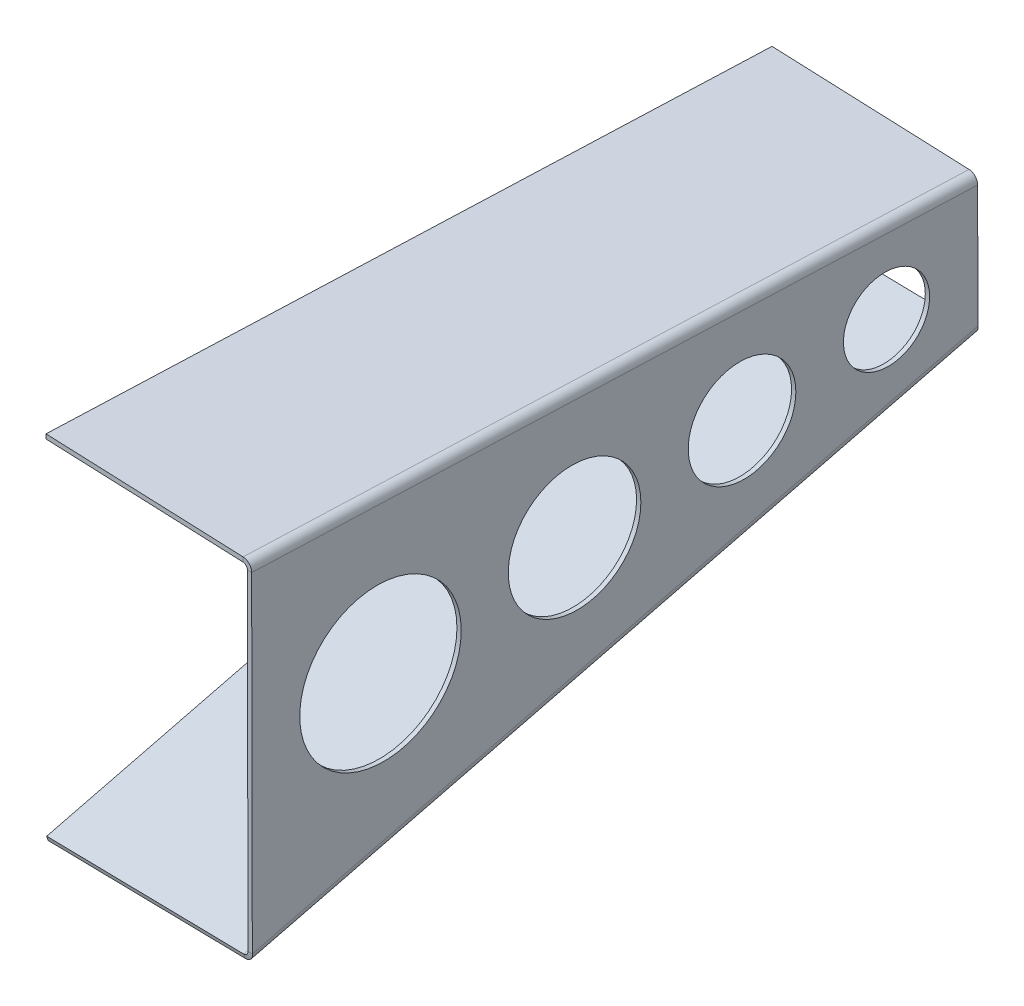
ISO-10303-21;
HEADER;
FILE_DESCRIPTION(('STEP AP214'),'2;1');
FILE_NAME('part.step','',(''),(''),'','','');
FILE_SCHEMA(('AUTOMOTIVE_DESIGN { 1 0 10303 214 1 1 1 1 }'));
ENDSEC;
DATA;
#1=APPLICATION_CONTEXT('core data for automotive mechanical design processes');
#2=APPLICATION_PROTOCOL_DEFINITION('international standard','automotive_design',2000,#1);
#3=PRODUCT_CONTEXT('',#1,'mechanical');
#4=PRODUCT('Part','Part','',(#3));
#5=PRODUCT_RELATED_PRODUCT_CATEGORY('part','',(#4));
#6=PRODUCT_DEFINITION_FORMATION('','',#4);
#7=PRODUCT_DEFINITION_CONTEXT('part definition',#1,'design');
#8=PRODUCT_DEFINITION('design','',#6,#7);
#9=PRODUCT_DEFINITION_SHAPE('','',#8);
#10=(LENGTH_UNIT() NAMED_UNIT(*) SI_UNIT(.MILLI.,.METRE.));
#11=(NAMED_UNIT(*) PLANE_ANGLE_UNIT() SI_UNIT($,.RADIAN.));
#12=(NAMED_UNIT(*) SI_UNIT($,.STERADIAN.) SOLID_ANGLE_UNIT());
#13=UNCERTAINTY_MEASURE_WITH_UNIT(LENGTH_MEASURE(1.E-05),#10,'distance_accuracy_value','');
#14=(GEOMETRIC_REPRESENTATION_CONTEXT(3) GLOBAL_UNCERTAINTY_ASSIGNED_CONTEXT((#13)) GLOBAL_UNIT_ASSIGNED_CONTEXT((#10,
#11,#12)) REPRESENTATION_CONTEXT('',''));
#15=CARTESIAN_POINT('',(0.,0.,0.));
#16=DIRECTION('',(0.,0.,1.));
#17=DIRECTION('',(1.,0.,0.));
#18=AXIS2_PLACEMENT_3D('',#15,#16,#17);
#19=CARTESIAN_POINT('',(3.40995484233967,-52.4237693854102,-1141.79603553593));
#20=DIRECTION('',(0.0392132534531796,7.70222097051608E-05,-0.999230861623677));
#21=DIRECTION('',(-0.00196418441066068,0.99999807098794,0.));
#22=AXIS2_PLACEMENT_3D('',#19,#20,#21);
#23=PLANE('',#22);
#24=DIRECTION('',(-0.999228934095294,-0.00196267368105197,-0.0392133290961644));
#25=VECTOR('',#24,1.);
#26=CARTESIAN_POINT('',(3.31655737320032,-4.87360634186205,-1141.79603553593));
#27=LINE('',#26,#25);
#28=CARTESIAN_POINT('',(4.94090392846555,-4.87041581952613,-1141.73229034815));
#29=VERTEX_POINT('',#28);
#30=CARTESIAN_POINT('',(3.31655737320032,-4.87360634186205,-1141.79603553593));
#31=VERTEX_POINT('',#30);
#32=EDGE_CURVE('E12',#29,#31,#27,.T.);
#33=ORIENTED_EDGE('',*,*,#32,.F.);
#34=DIRECTION('',(-0.00196418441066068,0.99999807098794,0.));
#35=VECTOR('',#34,1.);
#36=CARTESIAN_POINT('',(5.03430139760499,-52.4205788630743,-1141.73229034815));
#37=LINE('',#36,#35);
#38=CARTESIAN_POINT('',(5.02787209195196,-49.147315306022,-1141.73229034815));
#39=VERTEX_POINT('',#38);
#40=EDGE_CURVE('E140',#39,#29,#37,.T.);
#41=ORIENTED_EDGE('',*,*,#40,.F.);
#42=DIRECTION('',(-0.999228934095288,-0.00196267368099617,-0.0392133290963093));
#43=VECTOR('',#42,1.);
#44=CARTESIAN_POINT('',(3.40352553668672,-49.1505058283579,-1141.79603553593));
#45=LINE('',#44,#43);
#46=CARTESIAN_POINT('',(3.40352553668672,-49.1505058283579,-1141.79603553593));
#47=VERTEX_POINT('',#46);
#48=EDGE_CURVE('E93',#39,#47,#45,.T.);
#49=ORIENTED_EDGE('',*,*,#48,.T.);
#50=DIRECTION('',(-0.00196418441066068,0.99999807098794,0.));
#51=VECTOR('',#50,1.);
#52=CARTESIAN_POINT('',(3.40995484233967,-52.4237693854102,-1141.79603553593));
#53=LINE('',#52,#51);
#54=EDGE_CURVE('E142',#47,#31,#53,.T.);
#55=ORIENTED_EDGE('',*,*,#54,.T.);
#56=EDGE_LOOP('',(#33,#41,#49,#55));
#57=FACE_BOUND('',#56,.T.);
#58=ADVANCED_FACE('F82',(#57),#23,.T.);
#59=CARTESIAN_POINT('',(1.80375167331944,-52.4077804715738,-1142.32306807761));
#60=CARTESIAN_POINT('',(1.79667122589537,-51.8884337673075,-1142.16863895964));
#61=CARTESIAN_POINT('',(1.7895907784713,-51.3690870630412,-1142.01420984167));
#62=CARTESIAN_POINT('',(1.78251033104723,-50.849740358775,-1141.85978072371));
#63=CARTESIAN_POINT('',(-4.69363454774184,-52.4205425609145,-1142.57804882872));
#64=CARTESIAN_POINT('',(-3.6178172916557,-51.8990688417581,-1142.3811229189));
#65=CARTESIAN_POINT('',(-2.54200003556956,-51.3775951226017,-1142.18419700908));
#66=CARTESIAN_POINT('',(-1.46618277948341,-50.8561214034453,-1141.98727109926));
#67=CARTESIAN_POINT('',(-4.74277993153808,-45.9123743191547,-1141.65147412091));
#68=CARTESIAN_POINT('',(-3.6528017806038,-46.4295940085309,-1141.76340644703));
#69=CARTESIAN_POINT('',(-2.56282362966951,-46.946813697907,-1141.87533877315));
#70=CARTESIAN_POINT('',(-1.47284547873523,-47.4640333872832,-1141.98727109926));
#71=CARTESIAN_POINT('',(1.7546062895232,-45.899612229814,-1141.3964933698));
#72=CARTESIAN_POINT('',(1.76168673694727,-46.4189589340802,-1141.55092248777));
#73=CARTESIAN_POINT('',(1.76876718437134,-46.9383056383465,-1141.70535160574));
#74=CARTESIAN_POINT('',(1.77584763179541,-47.4576523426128,-1141.85978072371));
#75=CARTESIAN_POINT('',(8.25199251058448,-45.8868501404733,-1141.14151261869));
#76=CARTESIAN_POINT('',(7.17617525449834,-46.4083238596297,-1141.33843852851));
#77=CARTESIAN_POINT('',(6.10035799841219,-46.929797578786,-1141.53536443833));
#78=CARTESIAN_POINT('',(5.02454074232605,-47.4512712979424,-1141.73229034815));
#79=CARTESIAN_POINT('',(8.30113789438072,-52.3950183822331,-1142.0680873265));
#80=CARTESIAN_POINT('',(7.21115974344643,-51.8777986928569,-1141.95615500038));
#81=CARTESIAN_POINT('',(6.12118159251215,-51.3605790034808,-1141.84422267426));
#82=CARTESIAN_POINT('',(5.03120344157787,-50.8433593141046,-1141.73229034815));
#83=CARTESIAN_POINT('',(1.80375167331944,-52.4077804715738,-1142.32306807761));
#84=CARTESIAN_POINT('',(1.79667122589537,-51.8884337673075,-1142.16863895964));
#85=CARTESIAN_POINT('',(1.7895907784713,-51.3690870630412,-1142.01420984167));
#86=CARTESIAN_POINT('',(1.78251033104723,-50.849740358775,-1141.85978072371));
#87=(BOUNDED_SURFACE() B_SPLINE_SURFACE(3,3,((#59,#60,#61,#62),(#63,#64,#65,#66),(#67,#68,#69,
#70),(#71,#72,#73,#74),(#75,#76,#77,#78),(#79,#80,#81,#82),(#83,#84,#85,#86)),.UNSPECIFIED.,.T.,
.F.,.F.) B_SPLINE_SURFACE_WITH_KNOTS((4,3,4),(4,4),(0.,0.5,1.),(0.,1.),
.UNSPECIFIED.) GEOMETRIC_REPRESENTATION_ITEM() RATIONAL_B_SPLINE_SURFACE(((1.,1.,1.,1.),
(0.333333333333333,0.333333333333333,0.333333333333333,0.333333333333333),(0.333333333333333,
0.333333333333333,0.333333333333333,0.333333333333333),(1.,1.,1.,1.),(0.333333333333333,
0.333333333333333,0.333333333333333,0.333333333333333),(0.333333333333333,0.333333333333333,
0.333333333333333,0.333333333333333),(1.,1.,1.,1.))) REPRESENTATION_ITEM('') SURFACE());
#88=CARTESIAN_POINT('',(1.77917898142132,-49.1536963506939,-1141.85978072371));
#89=DIRECTION('',(-0.0385441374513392,-0.141130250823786,0.989240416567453));
#90=DIRECTION('',(0.00747574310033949,-0.989989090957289,-0.140945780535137));
#91=AXIS2_PLACEMENT_3D('',#88,#89,#90);
#92=ELLIPSE('',#91,3.28698987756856,3.2512);
#93=CARTESIAN_POINT('',(1.86590869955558,-52.4070626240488,-1142.32054381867));
#94=VERTEX_POINT('',#93);
#95=EDGE_CURVE('E187',#39,#94,#92,.F.);
#96=DIRECTION('',(-0.0321839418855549,0.95822700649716,0.284192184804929));
#97=VECTOR('',#96,1.);
#98=CARTESIAN_POINT('',(1.81359048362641,-50.8493688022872,-1141.85856100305));
#99=LINE('',#98,#97);
#100=CARTESIAN_POINT('',(1.81359048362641,-50.8493688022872,-1141.85856100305));
#101=VERTEX_POINT('',#100);
#102=EDGE_CURVE('E239',#94,#101,#99,.T.);
#103=CARTESIAN_POINT('',(1.77917898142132,-49.1536963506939,-1141.85978072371));
#104=DIRECTION('',(-0.0392132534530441,-7.70222097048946E-05,0.999230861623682));
#105=DIRECTION('',(0.00196418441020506,-0.999998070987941,0.));
#106=AXIS2_PLACEMENT_3D('',#103,#104,#105);
#107=ELLIPSE('',#106,1.69604727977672,1.6256);
#108=EDGE_CURVE('E317',#47,#101,#107,.F.);
#109=ORIENTED_EDGE('',*,*,#48,.F.);
#110=ORIENTED_EDGE('',*,*,#95,.T.);
#111=ORIENTED_EDGE('',*,*,#102,.T.);
#112=ORIENTED_EDGE('',*,*,#108,.F.);
#113=EDGE_LOOP('',(#109,#110,#111,#112));
#114=FACE_BOUND('',#113,.T.);
#115=ADVANCED_FACE('F358',(#114),#87,.T.);
#116=CARTESIAN_POINT('',(-72.7175233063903,-52.4851478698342,-1144.78354416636));
#117=DIRECTION('',(0.0313367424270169,0.285167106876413,-0.957965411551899));
#118=DIRECTION('',(0.998990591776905,0.0219254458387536,0.0392055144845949));
#119=AXIS2_PLACEMENT_3D('',#116,#117,#118);
#120=PLANE('',#119);
#121=ORIENTED_EDGE('',*,*,#102,.F.);
#122=DIRECTION('',(0.998990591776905,0.0219254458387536,0.0392055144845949));
#123=VECTOR('',#122,1.);
#124=CARTESIAN_POINT('',(-72.6652050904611,-54.042841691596,-1145.24552698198));
#125=LINE('',#124,#123);
#126=CARTESIAN_POINT('',(-72.6652050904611,-54.0428416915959,-1145.24552698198));
#127=VERTEX_POINT('',#126);
#128=EDGE_CURVE('E344',#127,#94,#125,.T.);
#129=ORIENTED_EDGE('',*,*,#128,.F.);
#130=DIRECTION('',(-0.0321839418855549,0.95822700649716,0.284192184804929));
#131=VECTOR('',#130,1.);
#132=CARTESIAN_POINT('',(-72.7175233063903,-52.4851478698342,-1144.78354416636));
#133=LINE('',#132,#131);
#134=CARTESIAN_POINT('',(-72.7175233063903,-52.4851478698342,-1144.78354416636));
#135=VERTEX_POINT('',#134);
#136=EDGE_CURVE('E235',#127,#135,#133,.T.);
#137=ORIENTED_EDGE('',*,*,#136,.T.);
#138=DIRECTION('',(0.998990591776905,0.0219254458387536,0.0392055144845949));
#139=VECTOR('',#138,1.);
#140=CARTESIAN_POINT('',(-72.7175233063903,-52.4851478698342,-1144.78354416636));
#141=LINE('',#140,#139);
#142=EDGE_CURVE('E298',#135,#101,#141,.T.);
#143=ORIENTED_EDGE('',*,*,#142,.T.);
#144=EDGE_LOOP('',(#121,#129,#137,#143));
#145=FACE_BOUND('',#144,.T.);
#146=ADVANCED_FACE('F366',(#145),#120,.T.);
#147=CARTESIAN_POINT('',(-82.5292291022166,-128.088396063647,-890.978905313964));
#148=DIRECTION('',(-0.998795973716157,-0.020301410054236,-0.0446593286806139));
#149=DIRECTION('',(0.0370242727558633,0.285287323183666,-0.95772665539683));
#150=AXIS2_PLACEMENT_3D('',#147,#148,#149);
#151=PLANE('',#150);
#152=ORIENTED_EDGE('',*,*,#136,.F.);
#153=DIRECTION('',(0.0370242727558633,0.285287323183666,-0.95772665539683));
#154=VECTOR('',#153,1.);
#155=CARTESIAN_POINT('',(-82.4769108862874,-129.646089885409,-891.440888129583));
#156=LINE('',#155,#154);
#157=CARTESIAN_POINT('',(-82.4769108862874,-129.646089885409,-891.440888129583));
#158=VERTEX_POINT('',#157);
#159=EDGE_CURVE('E196',#158,#127,#156,.T.);
#160=ORIENTED_EDGE('',*,*,#159,.F.);
#161=DIRECTION('',(-0.0321839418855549,0.95822700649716,0.284192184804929));
#162=VECTOR('',#161,1.);
#163=CARTESIAN_POINT('',(-82.5292291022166,-128.088396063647,-890.978905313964));
#164=LINE('',#163,#162);
#165=CARTESIAN_POINT('',(-82.5292291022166,-128.088396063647,-890.978905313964));
#166=VERTEX_POINT('',#165);
#167=EDGE_CURVE('E231',#158,#166,#164,.T.);
#168=ORIENTED_EDGE('',*,*,#167,.T.);
#169=DIRECTION('',(0.0370242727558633,0.285287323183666,-0.95772665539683));
#170=VECTOR('',#169,1.);
#171=CARTESIAN_POINT('',(-82.5292291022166,-128.088396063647,-890.978905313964));
#172=LINE('',#171,#170);
#173=EDGE_CURVE('E294',#166,#135,#172,.T.);
#174=ORIENTED_EDGE('',*,*,#173,.T.);
#175=EDGE_LOOP('',(#152,#160,#168,#174));
#176=FACE_BOUND('',#175,.T.);
#177=ADVANCED_FACE('F395',(#176),#151,.T.);
#178=CARTESIAN_POINT('',(-4.78062925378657,-126.382000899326,-887.927651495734));
#179=DIRECTION('',(-0.0313367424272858,-0.285167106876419,0.957965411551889));
#180=DIRECTION('',(-0.998990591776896,-0.021925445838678,-0.0392055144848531));
#181=AXIS2_PLACEMENT_3D('',#178,#179,#180);
#182=PLANE('',#181);
#183=ORIENTED_EDGE('',*,*,#167,.F.);
#184=DIRECTION('',(-0.998990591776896,-0.021925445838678,-0.0392055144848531));
#185=VECTOR('',#184,1.);
#186=CARTESIAN_POINT('',(-4.72831103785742,-127.939694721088,-888.389634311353));
#187=LINE('',#186,#185);
#188=CARTESIAN_POINT('',(-7.9457970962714,-128.010310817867,-888.515904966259));
#189=VERTEX_POINT('',#188);
#190=EDGE_CURVE('E184',#189,#158,#187,.T.);
#191=ORIENTED_EDGE('',*,*,#190,.F.);
#192=DIRECTION('',(-0.032183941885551,0.958227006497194,0.284192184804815));
#193=VECTOR('',#192,1.);
#194=CARTESIAN_POINT('',(-7.99811531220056,-126.452616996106,-888.05392215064));
#195=LINE('',#194,#193);
#196=CARTESIAN_POINT('',(-7.99811531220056,-126.452616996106,-888.05392215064));
#197=VERTEX_POINT('',#196);
#198=EDGE_CURVE('E227',#189,#197,#195,.T.);
#199=ORIENTED_EDGE('',*,*,#198,.T.);
#200=DIRECTION('',(-0.998990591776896,-0.021925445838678,-0.0392055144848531));
#201=VECTOR('',#200,1.);
#202=CARTESIAN_POINT('',(-4.78062925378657,-126.382000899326,-887.927651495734));
#203=LINE('',#202,#201);
#204=EDGE_CURVE('E302',#197,#166,#203,.T.);
#205=ORIENTED_EDGE('',*,*,#204,.T.);
#206=EDGE_LOOP('',(#183,#191,#199,#205));
#207=FACE_BOUND('',#206,.T.);
#208=ADVANCED_FACE('F396',(#207),#182,.T.);
#209=CARTESIAN_POINT('',(-8.00795412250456,-128.011028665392,-888.518429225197));
#210=CARTESIAN_POINT('',(-8.01503456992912,-127.491681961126,-888.364000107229));
#211=CARTESIAN_POINT('',(-8.02211501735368,-126.97233525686,-888.209570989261));
#212=CARTESIAN_POINT('',(-8.02919546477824,-126.452988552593,-888.055141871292));
#213=CARTESIAN_POINT('',(-1.51056790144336,-127.998266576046,-888.263448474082));
#214=CARTESIAN_POINT('',(-2.60054605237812,-127.481046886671,-888.151516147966));
#215=CARTESIAN_POINT('',(-3.69052420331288,-126.963827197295,-888.03958382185));
#216=CARTESIAN_POINT('',(-4.78050235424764,-126.44660750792,-887.927651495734));
#217=CARTESIAN_POINT('',(-1.55971328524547,-121.490098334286,-887.336873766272));
#218=CARTESIAN_POINT('',(-2.63553054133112,-122.011572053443,-887.533799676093));
#219=CARTESIAN_POINT('',(-3.71134779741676,-122.533045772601,-887.730725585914));
#220=CARTESIAN_POINT('',(-4.7871650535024,-123.054519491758,-887.927651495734));
#221=CARTESIAN_POINT('',(-8.05709950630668,-121.502860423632,-887.591854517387));
#222=CARTESIAN_POINT('',(-8.05001905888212,-122.022207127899,-887.746283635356));
#223=CARTESIAN_POINT('',(-8.04293861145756,-122.541553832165,-887.900712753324));
#224=CARTESIAN_POINT('',(-8.035858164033,-123.060900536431,-888.055141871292));
#225=CARTESIAN_POINT('',(-14.5544857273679,-121.515622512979,-887.846835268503));
#226=CARTESIAN_POINT('',(-13.4645075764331,-122.032842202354,-887.958767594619));
#227=CARTESIAN_POINT('',(-12.3745294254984,-122.550061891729,-888.070699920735));
#228=CARTESIAN_POINT('',(-11.2845512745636,-123.067281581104,-888.18263224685));
#229=CARTESIAN_POINT('',(-14.5053403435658,-128.023790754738,-888.773409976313));
#230=CARTESIAN_POINT('',(-13.4295230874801,-127.502317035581,-888.576484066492));
#231=CARTESIAN_POINT('',(-12.3537058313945,-126.980843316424,-888.379558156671));
#232=CARTESIAN_POINT('',(-11.2778885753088,-126.459369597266,-888.18263224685));
#233=CARTESIAN_POINT('',(-8.00795412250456,-128.011028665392,-888.518429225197));
#234=CARTESIAN_POINT('',(-8.01503456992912,-127.491681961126,-888.364000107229));
#235=CARTESIAN_POINT('',(-8.02211501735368,-126.97233525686,-888.209570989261));
#236=CARTESIAN_POINT('',(-8.02919546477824,-126.452988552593,-888.055141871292));
#237=(BOUNDED_SURFACE() B_SPLINE_SURFACE(3,3,((#209,#210,#211,#212),(#213,#214,#215,#216),(#217,
#218,#219,#220),(#221,#222,#223,#224),(#225,#226,#227,#228),(#229,#230,#231,#232),(#233,#234,
#235,#236)),.UNSPECIFIED.,.T.,.F.,.F.) B_SPLINE_SURFACE_WITH_KNOTS((4,3,4),(4,4),(0.,0.5,1.),
(0.,1.),.UNSPECIFIED.) GEOMETRIC_REPRESENTATION_ITEM() RATIONAL_B_SPLINE_SURFACE(((1.,1.,1.,1.),
(0.333333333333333,0.333333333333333,0.333333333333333,0.333333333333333),(0.333333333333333,
0.333333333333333,0.333333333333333,0.333333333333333),(1.,1.,1.,1.),(0.333333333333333,
0.333333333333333,0.333333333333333,0.333333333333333),(0.333333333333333,0.333333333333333,
0.333333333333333,0.333333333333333),(1.,1.,1.,1.))) REPRESENTATION_ITEM('') SURFACE());
#238=CARTESIAN_POINT('',(-8.03252681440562,-124.756944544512,-888.055141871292));
#239=DIRECTION('',(0.0385441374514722,0.141130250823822,-0.989240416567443));
#240=DIRECTION('',(0.00747574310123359,-0.989989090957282,-0.140945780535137));
#241=AXIS2_PLACEMENT_3D('',#238,#239,#240);
#242=ELLIPSE('',#241,3.28698987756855,3.2512);
#243=CARTESIAN_POINT('',(-4.78383370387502,-124.75056349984,-887.927651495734));
#244=VERTEX_POINT('',#243);
#245=EDGE_CURVE('E180',#189,#244,#242,.F.);
#246=DIRECTION('',(-0.999228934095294,-0.00196267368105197,-0.0392133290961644));
#247=VECTOR('',#246,1.);
#248=CARTESIAN_POINT('',(-6.40818025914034,-124.753754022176,-887.991396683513));
#249=LINE('',#248,#247);
#250=CARTESIAN_POINT('',(-6.40818025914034,-124.753754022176,-887.991396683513));
#251=VERTEX_POINT('',#250);
#252=EDGE_CURVE('E224',#244,#251,#249,.T.);
#253=CARTESIAN_POINT('',(-8.03252681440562,-124.756944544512,-888.055141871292));
#254=DIRECTION('',(0.0392132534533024,7.7022209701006E-05,-0.999230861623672));
#255=DIRECTION('',(0.00196418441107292,-0.999998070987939,0.));
#256=AXIS2_PLACEMENT_3D('',#253,#254,#255);
#257=ELLIPSE('',#256,1.69604727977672,1.6256);
#258=EDGE_CURVE('E313',#197,#251,#257,.F.);
#259=ORIENTED_EDGE('',*,*,#198,.F.);
#260=ORIENTED_EDGE('',*,*,#245,.T.);
#261=ORIENTED_EDGE('',*,*,#252,.T.);
#262=ORIENTED_EDGE('',*,*,#258,.F.);
#263=EDGE_LOOP('',(#259,#260,#261,#262));
#264=FACE_BOUND('',#263,.T.);
#265=ADVANCED_FACE('F398',(#264),#237,.T.);
#266=CARTESIAN_POINT('',(-6.65002399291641,-1.62719526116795,-887.991396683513));
#267=DIRECTION('',(-0.0392132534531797,-7.70222097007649E-05,0.999230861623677));
#268=DIRECTION('',(0.00196418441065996,-0.99999807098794,0.));
#269=AXIS2_PLACEMENT_3D('',#266,#267,#268);
#270=PLANE('',#269);
#271=ORIENTED_EDGE('',*,*,#252,.F.);
#272=DIRECTION('',(0.00196418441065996,-0.99999807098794,0.));
#273=VECTOR('',#272,1.);
#274=CARTESIAN_POINT('',(-5.02567743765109,-1.62400473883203,-887.927651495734));
#275=LINE('',#274,#273);
#276=CARTESIAN_POINT('',(-5.01930087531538,-4.87041581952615,-887.927651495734));
#277=VERTEX_POINT('',#276);
#278=EDGE_CURVE('E173',#277,#244,#275,.T.);
#279=ORIENTED_EDGE('',*,*,#278,.F.);
#280=DIRECTION('',(-0.999228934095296,-0.00196267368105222,-0.0392133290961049));
#281=VECTOR('',#280,1.);
#282=CARTESIAN_POINT('',(-6.64364743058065,-4.87360634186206,-887.991396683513));
#283=LINE('',#282,#281);
#284=CARTESIAN_POINT('',(-6.64364743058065,-4.87360634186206,-887.991396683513));
#285=VERTEX_POINT('',#284);
#286=EDGE_CURVE('E220',#277,#285,#283,.T.);
#287=ORIENTED_EDGE('',*,*,#286,.T.);
#288=DIRECTION('',(0.00196418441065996,-0.99999807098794,0.));
#289=VECTOR('',#288,1.);
#290=CARTESIAN_POINT('',(-6.65002399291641,-1.62719526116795,-887.991396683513));
#291=LINE('',#290,#289);
#292=EDGE_CURVE('E274',#285,#251,#291,.T.);
#293=ORIENTED_EDGE('',*,*,#292,.T.);
#294=EDGE_LOOP('',(#271,#279,#287,#293));
#295=FACE_BOUND('',#294,.T.);
#296=ADVANCED_FACE('F404',(#295),#270,.T.);
#297=CARTESIAN_POINT('',(-8.26161293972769,-8.1279906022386,-888.055016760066));
#298=CARTESIAN_POINT('',(-8.26267562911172,-7.58612497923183,-888.05505846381));
#299=CARTESIAN_POINT('',(-8.26373831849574,-7.04425935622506,-888.055100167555));
#300=CARTESIAN_POINT('',(-8.26480100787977,-6.50239373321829,-888.0551418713));
#301=CARTESIAN_POINT('',(-1.76422671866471,-8.11522851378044,-887.800036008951));
#302=CARTESIAN_POINT('',(-2.84818711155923,-7.5754899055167,-887.842574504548));
#303=CARTESIAN_POINT('',(-3.93214750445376,-7.03575129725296,-887.885113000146));
#304=CARTESIAN_POINT('',(-5.01610789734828,-6.49601268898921,-887.927651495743));
#305=CARTESIAN_POINT('',(-1.77698881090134,-1.6128410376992,-887.800286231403));
#306=CARTESIAN_POINT('',(-2.85882382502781,-2.156833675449,-887.842741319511));
#307=CARTESIAN_POINT('',(-3.94065883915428,-2.70082631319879,-887.885196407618));
#308=CARTESIAN_POINT('',(-5.02249385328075,-3.24481895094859,-887.927651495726));
#309=CARTESIAN_POINT('',(-8.27437503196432,-1.62560312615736,-888.055266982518));
#310=CARTESIAN_POINT('',(-8.27331234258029,-2.16746874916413,-888.055225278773));
#311=CARTESIAN_POINT('',(-8.27224965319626,-2.7093343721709,-888.055183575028));
#312=CARTESIAN_POINT('',(-8.27118696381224,-3.25119999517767,-888.055141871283));
#313=CARTESIAN_POINT('',(-14.7717612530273,-1.63836521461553,-888.310247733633));
#314=CARTESIAN_POINT('',(-13.6878008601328,-2.17810382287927,-888.267709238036));
#315=CARTESIAN_POINT('',(-12.6038404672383,-2.71784243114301,-888.225170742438));
#316=CARTESIAN_POINT('',(-11.5198800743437,-3.25758103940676,-888.182632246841));
#317=CARTESIAN_POINT('',(-14.7589991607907,-8.14075269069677,-888.309997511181));
#318=CARTESIAN_POINT('',(-13.6771641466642,-7.59676005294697,-888.267542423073));
#319=CARTESIAN_POINT('',(-12.5953291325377,-7.05276741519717,-888.225087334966));
#320=CARTESIAN_POINT('',(-11.5134941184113,-6.50877477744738,-888.182632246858));
#321=CARTESIAN_POINT('',(-8.26161293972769,-8.1279906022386,-888.055016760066));
#322=CARTESIAN_POINT('',(-8.26267562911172,-7.58612497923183,-888.05505846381));
#323=CARTESIAN_POINT('',(-8.26373831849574,-7.04425935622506,-888.055100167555));
#324=CARTESIAN_POINT('',(-8.26480100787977,-6.50239373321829,-888.0551418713));
#325=(BOUNDED_SURFACE() B_SPLINE_SURFACE(3,3,((#297,#298,#299,#300),(#301,#302,#303,#304),(#305,
#306,#307,#308),(#309,#310,#311,#312),(#313,#314,#315,#316),(#317,#318,#319,#320),(#321,#322,
#323,#324)),.UNSPECIFIED.,.T.,.F.,.F.) B_SPLINE_SURFACE_WITH_KNOTS((4,3,4),(4,4),(0.,0.5,1.),
(0.,1.),.UNSPECIFIED.) GEOMETRIC_REPRESENTATION_ITEM() RATIONAL_B_SPLINE_SURFACE(((1.,1.,1.,1.),
(0.333333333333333,0.333333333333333,0.333333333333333,0.333333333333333),(0.333333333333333,
0.333333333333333,0.333333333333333,0.333333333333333),(1.,1.,1.,1.),(0.333333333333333,
0.333333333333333,0.333333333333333,0.333333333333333),(0.333333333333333,0.333333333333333,
0.333333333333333,0.333333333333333),(1.,1.,1.,1.))) REPRESENTATION_ITEM('') SURFACE());
#326=CARTESIAN_POINT('',(-8.267993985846,-4.87679686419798,-888.055141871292));
#327=DIRECTION('',(0.0392133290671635,3.85111049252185E-05,-0.999230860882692));
#328=DIRECTION('',(0.00196267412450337,-0.999998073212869,3.8481553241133E-05));
#329=AXIS2_PLACEMENT_3D('',#326,#327,#328);
#330=ELLIPSE('',#329,3.25120000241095,3.2512);
#331=CARTESIAN_POINT('',(-8.26799889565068,-1.62559686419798,-888.055016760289));
#332=VERTEX_POINT('',#331);
#333=EDGE_CURVE('E158',#277,#332,#330,.F.);
#334=DIRECTION('',(0.,-1.,0.));
#335=VECTOR('',#334,1.);
#336=CARTESIAN_POINT('',(-8.26799889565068,-3.25119686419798,-888.055016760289));
#337=LINE('',#336,#335);
#338=CARTESIAN_POINT('',(-8.26799889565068,-3.25119686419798,-888.055016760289));
#339=VERTEX_POINT('',#338);
#340=EDGE_CURVE('E216',#332,#339,#337,.T.);
#341=CARTESIAN_POINT('',(-8.267993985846,-4.87679686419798,-888.055141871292));
#342=DIRECTION('',(0.0392132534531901,7.70222097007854E-05,-0.999230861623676));
#343=DIRECTION('',(0.00196418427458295,-0.999998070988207,-5.34015041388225E-12));
#344=AXIS2_PLACEMENT_3D('',#341,#342,#343);
#345=ELLIPSE('',#344,1.62560000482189,1.6256);
#346=EDGE_CURVE('E306',#285,#339,#345,.F.);
#347=ORIENTED_EDGE('',*,*,#286,.F.);
#348=ORIENTED_EDGE('',*,*,#333,.T.);
#349=ORIENTED_EDGE('',*,*,#340,.T.);
#350=ORIENTED_EDGE('',*,*,#346,.F.);
#351=EDGE_LOOP('',(#347,#348,#349,#350));
#352=FACE_BOUND('',#351,.T.);
#353=ADVANCED_FACE('F478',(#352),#325,.T.);
#354=CARTESIAN_POINT('',(-82.788226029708,-3.25119686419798,-890.979446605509));
#355=DIRECTION('',(0.0392132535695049,0.,-0.999230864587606));
#356=DIRECTION('',(0.999230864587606,0.,0.0392132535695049));
#357=AXIS2_PLACEMENT_3D('',#354,#355,#356);
#358=PLANE('',#357);
#359=ORIENTED_EDGE('',*,*,#340,.F.);
#360=DIRECTION('',(0.999230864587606,0.,0.0392132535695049));
#361=VECTOR('',#360,1.);
#362=CARTESIAN_POINT('',(-82.788226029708,-1.62559686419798,-890.979446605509));
#363=LINE('',#362,#361);
#364=CARTESIAN_POINT('',(-82.788226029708,-1.62559686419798,-890.979446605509));
#365=VERTEX_POINT('',#364);
#366=EDGE_CURVE('E172',#365,#332,#363,.T.);
#367=ORIENTED_EDGE('',*,*,#366,.F.);
#368=DIRECTION('',(0.,-1.,0.));
#369=VECTOR('',#368,1.);
#370=CARTESIAN_POINT('',(-82.788226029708,-3.25119686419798,-890.979446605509));
#371=LINE('',#370,#369);
#372=CARTESIAN_POINT('',(-82.788226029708,-3.25119686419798,-890.979446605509));
#373=VERTEX_POINT('',#372);
#374=EDGE_CURVE('E212',#365,#373,#371,.T.);
#375=ORIENTED_EDGE('',*,*,#374,.T.);
#376=DIRECTION('',(0.999230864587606,0.,0.0392132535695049));
#377=VECTOR('',#376,1.);
#378=CARTESIAN_POINT('',(-82.788226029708,-3.25119686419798,-890.979446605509));
#379=LINE('',#378,#377);
#380=EDGE_CURVE('E268',#373,#339,#379,.T.);
#381=ORIENTED_EDGE('',*,*,#380,.T.);
#382=EDGE_LOOP('',(#359,#367,#375,#381));
#383=FACE_BOUND('',#382,.T.);
#384=ADVANCED_FACE('F474',(#383),#358,.F.);
#385=CARTESIAN_POINT('',(-72.8280212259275,-3.25119686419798,-1144.78408545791));
#386=DIRECTION('',(0.999230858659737,0.,0.0392134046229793));
#387=DIRECTION('',(-0.0392134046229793,0.,0.999230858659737));
#388=AXIS2_PLACEMENT_3D('',#385,#386,#387);
#389=PLANE('',#388);
#390=ORIENTED_EDGE('',*,*,#374,.F.);
#391=DIRECTION('',(-0.0392134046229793,0.,0.999230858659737));
#392=VECTOR('',#391,1.);
#393=CARTESIAN_POINT('',(-72.8280212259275,-1.62559686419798,-1144.78408545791));
#394=LINE('',#393,#392);
#395=CARTESIAN_POINT('',(-72.8280212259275,-1.62559686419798,-1144.78408545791));
#396=VERTEX_POINT('',#395);
#397=EDGE_CURVE('E332',#396,#365,#394,.T.);
#398=ORIENTED_EDGE('',*,*,#397,.F.);
#399=DIRECTION('',(0.,-1.,0.));
#400=VECTOR('',#399,1.);
#401=CARTESIAN_POINT('',(-72.8280212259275,-3.25119686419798,-1144.78408545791));
#402=LINE('',#401,#400);
#403=CARTESIAN_POINT('',(-72.8280212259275,-3.25119686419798,-1144.78408545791));
#404=VERTEX_POINT('',#403);
#405=EDGE_CURVE('E208',#396,#404,#402,.T.);
#406=ORIENTED_EDGE('',*,*,#405,.T.);
#407=DIRECTION('',(-0.0392134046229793,0.,0.999230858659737));
#408=VECTOR('',#407,1.);
#409=CARTESIAN_POINT('',(-72.8280212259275,-3.25119686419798,-1144.78408545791));
#410=LINE('',#409,#408);
#411=EDGE_CURVE('E264',#404,#373,#410,.T.);
#412=ORIENTED_EDGE('',*,*,#411,.T.);
#413=EDGE_LOOP('',(#390,#398,#406,#412));
#414=FACE_BOUND('',#413,.T.);
#415=ADVANCED_FACE('F470',(#414),#389,.F.);
#416=CARTESIAN_POINT('',(3.31337065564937,-3.25119686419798,-1141.79603553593));
#417=DIRECTION('',(-0.0392132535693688,0.,0.999230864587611));
#418=DIRECTION('',(-0.999230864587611,0.,-0.0392132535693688));
#419=AXIS2_PLACEMENT_3D('',#416,#417,#418);
#420=PLANE('',#419);
#421=ORIENTED_EDGE('',*,*,#405,.F.);
#422=DIRECTION('',(-0.999230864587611,0.,-0.0392132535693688));
#423=VECTOR('',#422,1.);
#424=CARTESIAN_POINT('',(3.31337065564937,-1.62559686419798,-1141.79603553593));
#425=LINE('',#424,#423);
#426=CARTESIAN_POINT('',(1.69220590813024,-1.62559686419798,-1141.8596556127));
#427=VERTEX_POINT('',#426);
#428=EDGE_CURVE('E164',#427,#396,#425,.T.);
#429=ORIENTED_EDGE('',*,*,#428,.F.);
#430=DIRECTION('',(0.,-1.,0.));
#431=VECTOR('',#430,1.);
#432=CARTESIAN_POINT('',(1.69220590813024,-3.25119686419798,-1141.8596556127));
#433=LINE('',#432,#431);
#434=CARTESIAN_POINT('',(1.69220590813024,-3.25119686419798,-1141.8596556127));
#435=VERTEX_POINT('',#434);
#436=EDGE_CURVE('E86',#427,#435,#433,.T.);
#437=ORIENTED_EDGE('',*,*,#436,.T.);
#438=DIRECTION('',(-0.999230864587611,0.,-0.0392132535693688));
#439=VECTOR('',#438,1.);
#440=CARTESIAN_POINT('',(3.31337065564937,-3.25119686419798,-1141.79603553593));
#441=LINE('',#440,#439);
#442=EDGE_CURVE('E260',#435,#404,#441,.T.);
#443=ORIENTED_EDGE('',*,*,#442,.T.);
#444=EDGE_LOOP('',(#421,#429,#437,#443));
#445=FACE_BOUND('',#444,.T.);
#446=ADVANCED_FACE('F432',(#445),#420,.F.);
#447=CARTESIAN_POINT('',(-4.77550058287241,-58.1266567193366,-932.929892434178));
#448=DIRECTION('',(0.999228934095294,0.00196267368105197,0.0392133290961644));
#449=DIRECTION('',(0.0392134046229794,0.,-0.999230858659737));
#450=AXIS2_PLACEMENT_3D('',#447,#448,#449);
#451=CYLINDRICAL_SURFACE('',#450,28.2494732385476);
#452=CARTESIAN_POINT('',(-4.77550058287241,-58.1266567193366,-932.929892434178));
#453=DIRECTION('',(0.999228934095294,0.00196267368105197,0.0392133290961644));
#454=DIRECTION('',(0.0392134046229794,0.,-0.999230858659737));
#455=AXIS2_PLACEMENT_3D('',#452,#453,#454);
#456=CIRCLE('',#455,28.2494732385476);
#457=CARTESIAN_POINT('',(-3.66774255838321,-58.1266567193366,-961.157637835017));
#458=VERTEX_POINT('',#457);
#459=EDGE_CURVE('E290',#458,#458,#456,.F.);
#460=ORIENTED_EDGE('',*,*,#459,.T.);
#461=EDGE_LOOP('',(#460));
#462=FACE_BOUND('',#461,.T.);
#463=CARTESIAN_POINT('',(-3.15115402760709,-58.1234661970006,-932.866147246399));
#464=DIRECTION('',(0.999228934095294,0.00196267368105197,0.0392133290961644));
#465=DIRECTION('',(0.0392134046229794,0.,-0.999230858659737));
#466=AXIS2_PLACEMENT_3D('',#463,#464,#465);
#467=CIRCLE('',#466,28.2494732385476);
#468=CARTESIAN_POINT('',(-2.0433960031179,-58.1234661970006,-961.093892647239));
#469=VERTEX_POINT('',#468);
#470=EDGE_CURVE('E191',#469,#469,#467,.F.);
#471=ORIENTED_EDGE('',*,*,#470,.F.);
#472=EDGE_LOOP('',(#471));
#473=FACE_BOUND('',#472,.T.);
#474=ADVANCED_FACE('F423',(#462,#473),#451,.F.);
#475=CARTESIAN_POINT('',(2.11696699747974,-31.7714426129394,-1109.88196150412));
#476=DIRECTION('',(0.999228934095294,0.00196267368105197,0.0392133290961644));
#477=DIRECTION('',(0.0392134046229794,0.,-0.999230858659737));
#478=AXIS2_PLACEMENT_3D('',#475,#476,#477);
#479=CYLINDRICAL_SURFACE('',#478,15.0716142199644);
#480=CARTESIAN_POINT('',(2.11696699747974,-31.7714426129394,-1109.88196150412));
#481=DIRECTION('',(0.999228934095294,0.00196267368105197,0.0392133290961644));
#482=DIRECTION('',(0.0392134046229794,0.,-0.999230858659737));
#483=AXIS2_PLACEMENT_3D('',#480,#481,#482);
#484=CIRCLE('',#483,15.0716142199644);
#485=CARTESIAN_POINT('',(2.70797630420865,-31.7714426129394,-1124.94198352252));
#486=VERTEX_POINT('',#485);
#487=EDGE_CURVE('E286',#486,#486,#484,.F.);
#488=ORIENTED_EDGE('',*,*,#487,.T.);
#489=EDGE_LOOP('',(#488));
#490=FACE_BOUND('',#489,.T.);
#491=CARTESIAN_POINT('',(3.74131355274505,-31.7682520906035,-1109.81821631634));
#492=DIRECTION('',(0.999228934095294,0.00196267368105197,0.0392133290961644));
#493=DIRECTION('',(0.0392134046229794,0.,-0.999230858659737));
#494=AXIS2_PLACEMENT_3D('',#491,#492,#493);
#495=CIRCLE('',#494,15.0716142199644);
#496=CARTESIAN_POINT('',(4.33232285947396,-31.7682520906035,-1124.87823833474));
#497=VERTEX_POINT('',#496);
#498=EDGE_CURVE('E195',#497,#497,#495,.F.);
#499=ORIENTED_EDGE('',*,*,#498,.F.);
#500=EDGE_LOOP('',(#499));
#501=FACE_BOUND('',#500,.T.);
#502=ADVANCED_FACE('F431',(#490,#501),#479,.F.);
#503=CARTESIAN_POINT('',(0.148795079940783,-39.2972803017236,-1059.35258446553));
#504=DIRECTION('',(0.999228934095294,0.00196267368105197,0.0392133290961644));
#505=DIRECTION('',(0.0392134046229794,0.,-0.999230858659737));
#506=AXIS2_PLACEMENT_3D('',#503,#504,#505);
#507=CYLINDRICAL_SURFACE('',#506,18.8346050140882);
#508=CARTESIAN_POINT('',(0.148795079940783,-39.2972803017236,-1059.35258446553));
#509=DIRECTION('',(0.999228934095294,0.00196267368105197,0.0392133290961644));
#510=DIRECTION('',(0.0392134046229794,0.,-0.999230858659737));
#511=AXIS2_PLACEMENT_3D('',#508,#509,#510);
#512=CIRCLE('',#511,18.8346050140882);
#513=CARTESIAN_POINT('',(0.887364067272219,-39.2972803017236,-1078.17270300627));
#514=VERTEX_POINT('',#513);
#515=EDGE_CURVE('E282',#514,#514,#512,.F.);
#516=ORIENTED_EDGE('',*,*,#515,.T.);
#517=EDGE_LOOP('',(#516));
#518=FACE_BOUND('',#517,.T.);
#519=CARTESIAN_POINT('',(1.7731416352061,-39.2940897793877,-1059.28883927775));
#520=DIRECTION('',(0.999228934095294,0.00196267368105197,0.0392133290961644));
#521=DIRECTION('',(0.0392134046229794,0.,-0.999230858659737));
#522=AXIS2_PLACEMENT_3D('',#519,#520,#521);
#523=CIRCLE('',#522,18.8346050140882);
#524=CARTESIAN_POINT('',(2.51171062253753,-39.2940897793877,-1078.10895781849));
#525=VERTEX_POINT('',#524);
#526=EDGE_CURVE('E200',#525,#525,#523,.F.);
#527=ORIENTED_EDGE('',*,*,#526,.F.);
#528=EDGE_LOOP('',(#527));
#529=FACE_BOUND('',#528,.T.);
#530=ADVANCED_FACE('F435',(#518,#529),#507,.F.);
#531=CARTESIAN_POINT('',(-2.1321282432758,-48.0190075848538,-1000.79386123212));
#532=DIRECTION('',(0.999228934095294,0.00196267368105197,0.0392133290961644));
#533=DIRECTION('',(0.0392134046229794,0.,-0.999230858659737));
#534=AXIS2_PLACEMENT_3D('',#531,#532,#533);
#535=CYLINDRICAL_SURFACE('',#534,23.1955520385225);
#536=CARTESIAN_POINT('',(-2.1321282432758,-48.0190075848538,-1000.79386123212));
#537=DIRECTION('',(0.999228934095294,0.00196267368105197,0.0392133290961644));
#538=DIRECTION('',(0.0392134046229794,0.,-0.999230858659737));
#539=AXIS2_PLACEMENT_3D('',#536,#537,#538);
#540=CIRCLE('',#539,23.1955520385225);
#541=CARTESIAN_POINT('',(-1.22255167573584,-48.0190075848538,-1023.97157261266));
#542=VERTEX_POINT('',#541);
#543=EDGE_CURVE('E278',#542,#542,#540,.F.);
#544=ORIENTED_EDGE('',*,*,#543,.T.);
#545=EDGE_LOOP('',(#544));
#546=FACE_BOUND('',#545,.T.);
#547=CARTESIAN_POINT('',(-0.507781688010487,-48.0158170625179,-1000.73011604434));
#548=DIRECTION('',(0.999228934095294,0.00196267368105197,0.0392133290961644));
#549=DIRECTION('',(0.0392134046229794,0.,-0.999230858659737));
#550=AXIS2_PLACEMENT_3D('',#547,#548,#549);
#551=CIRCLE('',#550,23.1955520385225);
#552=CARTESIAN_POINT('',(0.401794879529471,-48.0158170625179,-1023.90782742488));
#553=VERTEX_POINT('',#552);
#554=EDGE_CURVE('E204',#553,#553,#551,.F.);
#555=ORIENTED_EDGE('',*,*,#554,.F.);
#556=EDGE_LOOP('',(#555));
#557=FACE_BOUND('',#556,.T.);
#558=ADVANCED_FACE('F84',(#546,#557),#535,.F.);
#559=CARTESIAN_POINT('',(1.69859186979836,-8.12799060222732,-1141.85965561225));
#560=CARTESIAN_POINT('',(1.69752917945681,-7.58612497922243,-1141.85969731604));
#561=CARTESIAN_POINT('',(1.69646648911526,-7.04425935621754,-1141.85973901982));
#562=CARTESIAN_POINT('',(1.69540379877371,-6.50239373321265,-1141.8597807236));
#563=CARTESIAN_POINT('',(-4.79879435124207,-8.14075270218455,-1142.11463636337));
#564=CARTESIAN_POINT('',(-3.71695933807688,-7.59676006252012,-1142.0721812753));
#565=CARTESIAN_POINT('',(-2.63512432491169,-7.0527674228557,-1142.02972618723));
#566=CARTESIAN_POINT('',(-1.5532893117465,-6.50877478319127,-1141.98727109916));
#567=CARTESIAN_POINT('',(-4.81155645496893,-1.63836522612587,-1142.11488658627));
#568=CARTESIAN_POINT('',(-3.72759606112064,-2.17810383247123,-1142.07234809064));
#569=CARTESIAN_POINT('',(-2.64363566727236,-2.71784243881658,-1142.029809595));
#570=CARTESIAN_POINT('',(-1.55967527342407,-3.25758104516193,-1141.98727109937));
#571=CARTESIAN_POINT('',(1.6858297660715,-1.62560312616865,-1141.85990583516));
#572=CARTESIAN_POINT('',(1.68689245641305,-2.16746874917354,-1141.85986413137));
#573=CARTESIAN_POINT('',(1.68795514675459,-2.70933437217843,-1141.85982242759));
#574=CARTESIAN_POINT('',(1.68901783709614,-3.25119999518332,-1141.85978072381));
#575=CARTESIAN_POINT('',(8.18321598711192,-1.61284102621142,-1141.60492508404));
#576=CARTESIAN_POINT('',(7.10138097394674,-2.15683366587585,-1141.64738017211));
#577=CARTESIAN_POINT('',(6.01954596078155,-2.70082630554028,-1141.68983526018));
#578=CARTESIAN_POINT('',(4.93771094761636,-3.2448189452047,-1141.73229034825));
#579=CARTESIAN_POINT('',(8.19597809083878,-8.11522850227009,-1141.60467486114));
#580=CARTESIAN_POINT('',(7.1120176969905,-7.57548989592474,-1141.64721335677));
#581=CARTESIAN_POINT('',(6.02805730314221,-7.03575128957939,-1141.68975185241));
#582=CARTESIAN_POINT('',(4.94409690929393,-6.49601268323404,-1141.73229034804));
#583=CARTESIAN_POINT('',(1.69859186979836,-8.12799060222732,-1141.85965561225));
#584=CARTESIAN_POINT('',(1.69752917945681,-7.58612497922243,-1141.85969731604));
#585=CARTESIAN_POINT('',(1.69646648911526,-7.04425935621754,-1141.85973901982));
#586=CARTESIAN_POINT('',(1.69540379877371,-6.50239373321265,-1141.8597807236));
#587=(BOUNDED_SURFACE() B_SPLINE_SURFACE(3,3,((#559,#560,#561,#562),(#563,#564,#565,#566),(#567,
#568,#569,#570),(#571,#572,#573,#574),(#575,#576,#577,#578),(#579,#580,#581,#582),(#583,#584,
#585,#586)),.UNSPECIFIED.,.T.,.F.,.F.) B_SPLINE_SURFACE_WITH_KNOTS((4,3,4),(4,4),(0.,0.5,1.),
(0.,1.),.UNSPECIFIED.) GEOMETRIC_REPRESENTATION_ITEM() RATIONAL_B_SPLINE_SURFACE(((1.,1.,1.,1.),
(0.333333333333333,0.333333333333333,0.333333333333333,0.333333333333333),(0.333333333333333,
0.333333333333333,0.333333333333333,0.333333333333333),(1.,1.,1.,1.),(0.333333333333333,
0.333333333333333,0.333333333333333,0.333333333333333),(0.333333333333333,0.333333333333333,
0.333333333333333,0.333333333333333),(1.,1.,1.,1.))) REPRESENTATION_ITEM('') SURFACE());
#588=CARTESIAN_POINT('',(1.69221081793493,-4.87679686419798,-1141.85978072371));
#589=DIRECTION('',(-0.0392133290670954,-3.85111049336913E-05,0.999230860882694));
#590=DIRECTION('',(0.0019626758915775,-0.999998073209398,3.84816225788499E-05));
#591=AXIS2_PLACEMENT_3D('',#588,#589,#590);
#592=ELLIPSE('',#591,3.25120000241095,3.2512);
#593=EDGE_CURVE('E155',#427,#29,#592,.F.);
#594=CARTESIAN_POINT('',(1.69221081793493,-4.87679686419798,-1141.85978072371));
#595=DIRECTION('',(-0.039213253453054,-7.70222097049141E-05,0.999230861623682));
#596=DIRECTION('',(0.00196418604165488,-0.999998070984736,6.40016941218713E-11));
#597=AXIS2_PLACEMENT_3D('',#594,#595,#596);
#598=ELLIPSE('',#597,1.62560000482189,1.6256);
#599=EDGE_CURVE('E310',#435,#31,#598,.F.);
#600=ORIENTED_EDGE('',*,*,#593,.T.);
#601=ORIENTED_EDGE('',*,*,#32,.T.);
#602=ORIENTED_EDGE('',*,*,#599,.F.);
#603=ORIENTED_EDGE('',*,*,#436,.F.);
#604=EDGE_LOOP('',(#600,#601,#602,#603));
#605=FACE_BOUND('',#604,.T.);
#606=ADVANCED_FACE('F176',(#605),#587,.T.);
#607=CARTESIAN_POINT('',(0.0031929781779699,-3.25119686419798,0.));
#608=DIRECTION('',(0.,-1.,0.));
#609=DIRECTION('',(0.,0.,-1.));
#610=AXIS2_PLACEMENT_3D('',#607,#608,#609);
#611=PLANE('',#610);
#612=ORIENTED_EDGE('',*,*,#442,.F.);
#613=DIRECTION('',(0.0392134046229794,0.,-0.999230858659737));
#614=VECTOR('',#613,1.);
#615=CARTESIAN_POINT('',(-43.0521567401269,-3.25119686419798,-1.68964642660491));
#616=LINE('',#615,#614);
#617=EDGE_CURVE('E253',#435,#339,#616,.F.);
#618=ORIENTED_EDGE('',*,*,#617,.T.);
#619=ORIENTED_EDGE('',*,*,#380,.F.);
#620=ORIENTED_EDGE('',*,*,#411,.F.);
#621=EDGE_LOOP('',(#612,#618,#619,#620));
#622=FACE_BOUND('',#621,.T.);
#623=ADVANCED_FACE('F422',(#622),#611,.T.);
#624=CARTESIAN_POINT('',(-41.4372134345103,-0.0813904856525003,-1.62614495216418));
#625=DIRECTION('',(0.999228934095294,0.00196267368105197,0.0392133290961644));
#626=DIRECTION('',(0.0392134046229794,0.,-0.999230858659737));
#627=AXIS2_PLACEMENT_3D('',#624,#625,#626);
#628=PLANE('',#627);
#629=ORIENTED_EDGE('',*,*,#459,.F.);
#630=EDGE_LOOP('',(#629));
#631=FACE_BOUND('',#630,.T.);
#632=ORIENTED_EDGE('',*,*,#487,.F.);
#633=EDGE_LOOP('',(#632));
#634=FACE_BOUND('',#633,.T.);
#635=ORIENTED_EDGE('',*,*,#515,.F.);
#636=EDGE_LOOP('',(#635));
#637=FACE_BOUND('',#636,.T.);
#638=ORIENTED_EDGE('',*,*,#543,.F.);
#639=EDGE_LOOP('',(#638));
#640=FACE_BOUND('',#639,.T.);
#641=ORIENTED_EDGE('',*,*,#54,.F.);
#642=DIRECTION('',(0.0370242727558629,0.285287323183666,-0.95772665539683));
#643=VECTOR('',#642,1.);
#644=CARTESIAN_POINT('',(-6.42575077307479,-124.889142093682,-887.536890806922));
#645=LINE('',#644,#643);
#646=EDGE_CURVE('E246',#47,#251,#645,.F.);
#647=ORIENTED_EDGE('',*,*,#646,.T.);
#648=ORIENTED_EDGE('',*,*,#292,.F.);
#649=DIRECTION('',(0.0392134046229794,0.,-0.999230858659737));
#650=VECTOR('',#649,1.);
#651=CARTESIAN_POINT('',(-41.4278150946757,-4.87360634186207,-1.62577612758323));
#652=LINE('',#651,#650);
#653=EDGE_CURVE('E257',#285,#31,#652,.T.);
#654=ORIENTED_EDGE('',*,*,#653,.T.);
#655=EDGE_LOOP('',(#641,#647,#648,#654));
#656=FACE_BOUND('',#655,.T.);
#657=ADVANCED_FACE('F504',(#631,#634,#637,#640,#656),#628,.F.);
#658=CARTESIAN_POINT('',(12.0609151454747,-357.564531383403,-106.529065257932));
#659=DIRECTION('',(0.0321839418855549,-0.95822700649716,-0.284192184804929));
#660=DIRECTION('',(0.,0.284339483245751,-0.958723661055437));
#661=AXIS2_PLACEMENT_3D('',#658,#659,#660);
#662=PLANE('',#661);
#663=ORIENTED_EDGE('',*,*,#204,.F.);
#664=DIRECTION('',(0.0370242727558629,0.285287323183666,-0.95772665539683));
#665=VECTOR('',#664,1.);
#666=CARTESIAN_POINT('',(1.81392668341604,-50.8467782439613,-1141.86725766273));
#667=LINE('',#666,#665);
#668=EDGE_CURVE('E249',#197,#101,#667,.T.);
#669=ORIENTED_EDGE('',*,*,#668,.T.);
#670=ORIENTED_EDGE('',*,*,#142,.F.);
#671=ORIENTED_EDGE('',*,*,#173,.F.);
#672=EDGE_LOOP('',(#663,#669,#670,#671));
#673=FACE_BOUND('',#672,.T.);
#674=ADVANCED_FACE('F373',(#673),#662,.F.);
#675=CARTESIAN_POINT('',(-43.052161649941,-4.87679686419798,-1.68952131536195));
#676=DIRECTION('',(0.0392134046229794,0.,-0.999230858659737));
#677=DIRECTION('',(-0.999230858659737,0.,-0.0392134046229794));
#678=AXIS2_PLACEMENT_3D('',#675,#676,#677);
#679=CYLINDRICAL_SURFACE('',#678,1.6256);
#680=ORIENTED_EDGE('',*,*,#346,.T.);
#681=ORIENTED_EDGE('',*,*,#617,.F.);
#682=ORIENTED_EDGE('',*,*,#599,.T.);
#683=ORIENTED_EDGE('',*,*,#653,.F.);
#684=EDGE_LOOP('',(#680,#681,#682,#683));
#685=FACE_BOUND('',#684,.T.);
#686=ADVANCED_FACE('F507',(#685),#679,.F.);
#687=CARTESIAN_POINT('',(-38.1762629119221,-357.026889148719,-108.31100633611));
#688=DIRECTION('',(-0.0370242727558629,-0.285287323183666,0.95772665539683));
#689=DIRECTION('',(0.,-0.958383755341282,-0.285483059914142));
#690=AXIS2_PLACEMENT_3D('',#687,#688,#689);
#691=CYLINDRICAL_SURFACE('',#690,1.6256);
#692=ORIENTED_EDGE('',*,*,#258,.T.);
#693=ORIENTED_EDGE('',*,*,#646,.F.);
#694=ORIENTED_EDGE('',*,*,#108,.T.);
#695=ORIENTED_EDGE('',*,*,#668,.F.);
#696=EDGE_LOOP('',(#692,#693,#694,#695));
#697=FACE_BOUND('',#696,.T.);
#698=ADVANCED_FACE('F376',(#697),#691,.F.);
#699=CARTESIAN_POINT('',(0.0031929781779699,-1.62559686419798,0.));
#700=DIRECTION('',(0.,-1.,0.));
#701=DIRECTION('',(0.,0.,-1.));
#702=AXIS2_PLACEMENT_3D('',#699,#700,#701);
#703=PLANE('',#702);
#704=ORIENTED_EDGE('',*,*,#428,.T.);
#705=ORIENTED_EDGE('',*,*,#397,.T.);
#706=ORIENTED_EDGE('',*,*,#366,.T.);
#707=DIRECTION('',(0.0392134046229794,0.,-0.999230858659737));
#708=VECTOR('',#707,1.);
#709=CARTESIAN_POINT('',(-43.052161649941,-1.62559686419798,-1.68952131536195));
#710=LINE('',#709,#708);
#711=EDGE_CURVE('E163',#427,#332,#710,.F.);
#712=ORIENTED_EDGE('',*,*,#711,.F.);
#713=EDGE_LOOP('',(#704,#705,#706,#712));
#714=FACE_BOUND('',#713,.T.);
#715=ADVANCED_FACE('F449',(#714),#703,.F.);
#716=CARTESIAN_POINT('',(-39.812866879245,-0.0781999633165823,-1.56239976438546));
#717=DIRECTION('',(0.999228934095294,0.00196267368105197,0.0392133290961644));
#718=DIRECTION('',(0.0392134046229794,0.,-0.999230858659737));
#719=AXIS2_PLACEMENT_3D('',#716,#717,#718);
#720=PLANE('',#719);
#721=ORIENTED_EDGE('',*,*,#470,.T.);
#722=EDGE_LOOP('',(#721));
#723=FACE_BOUND('',#722,.T.);
#724=ORIENTED_EDGE('',*,*,#498,.T.);
#725=EDGE_LOOP('',(#724));
#726=FACE_BOUND('',#725,.T.);
#727=ORIENTED_EDGE('',*,*,#526,.T.);
#728=EDGE_LOOP('',(#727));
#729=FACE_BOUND('',#728,.T.);
#730=ORIENTED_EDGE('',*,*,#554,.T.);
#731=EDGE_LOOP('',(#730));
#732=FACE_BOUND('',#731,.T.);
#733=ORIENTED_EDGE('',*,*,#40,.T.);
#734=DIRECTION('',(0.0392134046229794,0.,-0.999230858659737));
#735=VECTOR('',#734,1.);
#736=CARTESIAN_POINT('',(-39.8034685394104,-4.87041581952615,-1.5620309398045));
#737=LINE('',#736,#735);
#738=EDGE_CURVE('E152',#277,#29,#737,.T.);
#739=ORIENTED_EDGE('',*,*,#738,.F.);
#740=ORIENTED_EDGE('',*,*,#278,.T.);
#741=DIRECTION('',(-0.0370242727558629,-0.285287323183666,0.95772665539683));
#742=VECTOR('',#741,1.);
#743=CARTESIAN_POINT('',(-34.9275698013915,-357.020508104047,-108.183515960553));
#744=LINE('',#743,#742);
#745=EDGE_CURVE('E169',#39,#244,#744,.T.);
#746=ORIENTED_EDGE('',*,*,#745,.F.);
#747=EDGE_LOOP('',(#733,#739,#740,#746));
#748=FACE_BOUND('',#747,.T.);
#749=ADVANCED_FACE('F167',(#723,#726,#729,#732,#748),#720,.T.);
#750=CARTESIAN_POINT('',(12.1132333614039,-359.122225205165,-106.99104807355));
#751=DIRECTION('',(0.0321839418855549,-0.95822700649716,-0.284192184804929));
#752=DIRECTION('',(0.,0.284339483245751,-0.958723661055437));
#753=AXIS2_PLACEMENT_3D('',#750,#751,#752);
#754=PLANE('',#753);
#755=ORIENTED_EDGE('',*,*,#190,.T.);
#756=ORIENTED_EDGE('',*,*,#159,.T.);
#757=ORIENTED_EDGE('',*,*,#128,.T.);
#758=DIRECTION('',(-0.0370242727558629,-0.285287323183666,0.95772665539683));
#759=VECTOR('',#758,1.);
#760=CARTESIAN_POINT('',(-38.0716264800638,-360.142276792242,-109.234971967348));
#761=LINE('',#760,#759);
#762=EDGE_CURVE('E323',#189,#94,#761,.F.);
#763=ORIENTED_EDGE('',*,*,#762,.F.);
#764=EDGE_LOOP('',(#755,#756,#757,#763));
#765=FACE_BOUND('',#764,.T.);
#766=ADVANCED_FACE('F364',(#765),#754,.T.);
#767=CARTESIAN_POINT('',(-43.052161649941,-4.87679686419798,-1.68952131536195));
#768=DIRECTION('',(0.0392134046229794,0.,-0.999230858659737));
#769=DIRECTION('',(-0.999230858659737,0.,-0.0392134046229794));
#770=AXIS2_PLACEMENT_3D('',#767,#768,#769);
#771=CYLINDRICAL_SURFACE('',#770,3.2512);
#772=ORIENTED_EDGE('',*,*,#333,.F.);
#773=ORIENTED_EDGE('',*,*,#738,.T.);
#774=ORIENTED_EDGE('',*,*,#593,.F.);
#775=ORIENTED_EDGE('',*,*,#711,.T.);
#776=EDGE_LOOP('',(#772,#773,#774,#775));
#777=FACE_BOUND('',#776,.T.);
#778=ADVANCED_FACE('F153',(#777),#771,.T.);
#779=CARTESIAN_POINT('',(-38.1762629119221,-357.026889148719,-108.31100633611));
#780=DIRECTION('',(-0.0370242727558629,-0.285287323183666,0.95772665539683));
#781=DIRECTION('',(0.,-0.958383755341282,-0.285483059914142));
#782=AXIS2_PLACEMENT_3D('',#779,#780,#781);
#783=CYLINDRICAL_SURFACE('',#782,3.2512);
#784=ORIENTED_EDGE('',*,*,#245,.F.);
#785=ORIENTED_EDGE('',*,*,#762,.T.);
#786=ORIENTED_EDGE('',*,*,#95,.F.);
#787=ORIENTED_EDGE('',*,*,#745,.T.);
#788=EDGE_LOOP('',(#784,#785,#786,#787));
#789=FACE_BOUND('',#788,.T.);
#790=ADVANCED_FACE('F362',(#789),#783,.T.);
#791=CLOSED_SHELL('',(#58,#115,#146,#177,#208,#265,#296,#353,#384,#415,#446,#474,#502,#530,#558,
#606,#623,#657,#674,#686,#698,#715,#749,#766,#778,#790));
#792=MANIFOLD_SOLID_BREP('B2',#791);
#793=ADVANCED_BREP_SHAPE_REPRESENTATION('',(#18,#792),#14);
#794=SHAPE_DEFINITION_REPRESENTATION(#9,#793);
ENDSEC;
END-ISO-10303-21;
